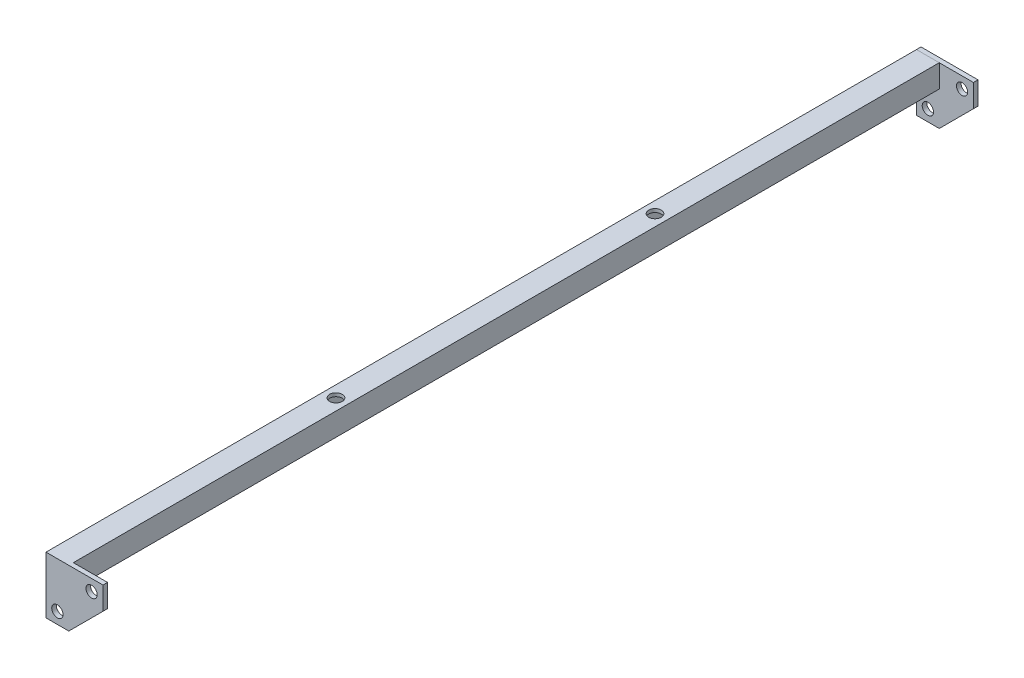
ISO-10303-21;
HEADER;
FILE_DESCRIPTION(('STEP AP214'),'2;1');
FILE_NAME('part.step','',(''),(''),'','','');
FILE_SCHEMA(('AUTOMOTIVE_DESIGN { 1 0 10303 214 1 1 1 1 }'));
ENDSEC;
DATA;
#1=APPLICATION_CONTEXT('core data for automotive mechanical design processes');
#2=APPLICATION_PROTOCOL_DEFINITION('international standard','automotive_design',2000,#1);
#3=PRODUCT_CONTEXT('',#1,'mechanical');
#4=PRODUCT('Part','Part','',(#3));
#5=PRODUCT_RELATED_PRODUCT_CATEGORY('part','',(#4));
#6=PRODUCT_DEFINITION_FORMATION('','',#4);
#7=PRODUCT_DEFINITION_CONTEXT('part definition',#1,'design');
#8=PRODUCT_DEFINITION('design','',#6,#7);
#9=PRODUCT_DEFINITION_SHAPE('','',#8);
#10=(LENGTH_UNIT() NAMED_UNIT(*) SI_UNIT(.MILLI.,.METRE.));
#11=(NAMED_UNIT(*) PLANE_ANGLE_UNIT() SI_UNIT($,.RADIAN.));
#12=(NAMED_UNIT(*) SI_UNIT($,.STERADIAN.) SOLID_ANGLE_UNIT());
#13=UNCERTAINTY_MEASURE_WITH_UNIT(LENGTH_MEASURE(1.E-05),#10,'distance_accuracy_value','');
#14=(GEOMETRIC_REPRESENTATION_CONTEXT(3) GLOBAL_UNCERTAINTY_ASSIGNED_CONTEXT((#13)) GLOBAL_UNIT_ASSIGNED_CONTEXT((#10,
#11,#12)) REPRESENTATION_CONTEXT('',''));
#15=CARTESIAN_POINT('',(0.,0.,0.));
#16=DIRECTION('',(0.,0.,1.));
#17=DIRECTION('',(1.,0.,0.));
#18=AXIS2_PLACEMENT_3D('',#15,#16,#17);
#19=CARTESIAN_POINT('',(50.0000000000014,719.999999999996,763.999999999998));
#20=DIRECTION('',(0.,0.,1.));
#21=DIRECTION('',(1.,0.,0.));
#22=AXIS2_PLACEMENT_3D('',#19,#20,#21);
#23=PLANE('',#22);
#24=CARTESIAN_POINT('',(40.0000000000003,760.000000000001,763.999999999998));
#25=DIRECTION('',(0.,0.,-1.));
#26=DIRECTION('',(-1.,0.,0.));
#27=AXIS2_PLACEMENT_3D('',#24,#25,#26);
#28=CIRCLE('',#27,4.90359405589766);
#29=CARTESIAN_POINT('',(35.0964059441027,760.000000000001,763.999999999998));
#30=VERTEX_POINT('',#29);
#31=EDGE_CURVE('E269',#30,#30,#28,.T.);
#32=ORIENTED_EDGE('',*,*,#31,.F.);
#33=EDGE_LOOP('',(#32));
#34=FACE_BOUND('',#33,.T.);
#35=DIRECTION('',(0.,1.,0.));
#36=VECTOR('',#35,1.);
#37=CARTESIAN_POINT('',(1.36491529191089E-12,769.999999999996,763.999999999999));
#38=LINE('',#37,#36);
#39=CARTESIAN_POINT('',(-2.52565716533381E-13,719.999999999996,763.999999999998));
#40=VERTEX_POINT('',#39);
#41=CARTESIAN_POINT('',(0.,750.,763.999999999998));
#42=VERTEX_POINT('',#41);
#43=EDGE_CURVE('E295',#40,#42,#38,.T.);
#44=ORIENTED_EDGE('',*,*,#43,.T.);
#45=DIRECTION('',(1.,0.,0.));
#46=VECTOR('',#45,1.);
#47=CARTESIAN_POINT('',(-1.54560033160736E-13,750.,763.999999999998));
#48=LINE('',#47,#46);
#49=CARTESIAN_POINT('',(20.0000000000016,750.,763.999999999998));
#50=VERTEX_POINT('',#49);
#51=EDGE_CURVE('E158',#42,#50,#48,.T.);
#52=ORIENTED_EDGE('',*,*,#51,.T.);
#53=DIRECTION('',(0.,1.,0.));
#54=VECTOR('',#53,1.);
#55=CARTESIAN_POINT('',(20.0000000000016,770.,763.999999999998));
#56=LINE('',#55,#54);
#57=CARTESIAN_POINT('',(20.0000000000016,769.999999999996,763.999999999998));
#58=VERTEX_POINT('',#57);
#59=EDGE_CURVE('E146',#50,#58,#56,.T.);
#60=ORIENTED_EDGE('',*,*,#59,.T.);
#61=DIRECTION('',(1.,0.,0.));
#62=VECTOR('',#61,1.);
#63=CARTESIAN_POINT('',(50.0000000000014,769.999999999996,763.999999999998));
#64=LINE('',#63,#62);
#65=CARTESIAN_POINT('',(50.0000000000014,769.999999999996,763.999999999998));
#66=VERTEX_POINT('',#65);
#67=EDGE_CURVE('E159',#58,#66,#64,.T.);
#68=ORIENTED_EDGE('',*,*,#67,.T.);
#69=DIRECTION('',(0.,-1.,0.));
#70=VECTOR('',#69,1.);
#71=CARTESIAN_POINT('',(50.0000000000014,749.999999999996,763.999999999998));
#72=LINE('',#71,#70);
#73=CARTESIAN_POINT('',(50.0000000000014,749.999999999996,763.999999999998));
#74=VERTEX_POINT('',#73);
#75=EDGE_CURVE('E313',#66,#74,#72,.T.);
#76=ORIENTED_EDGE('',*,*,#75,.T.);
#77=DIRECTION('',(-0.707106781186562,-0.707106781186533,0.));
#78=VECTOR('',#77,1.);
#79=CARTESIAN_POINT('',(20.0000000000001,719.999999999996,763.999999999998));
#80=LINE('',#79,#78);
#81=CARTESIAN_POINT('',(20.0000000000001,719.999999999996,763.999999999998));
#82=VERTEX_POINT('',#81);
#83=EDGE_CURVE('E312',#74,#82,#80,.T.);
#84=ORIENTED_EDGE('',*,*,#83,.T.);
#85=DIRECTION('',(-1.,0.,0.));
#86=VECTOR('',#85,1.);
#87=CARTESIAN_POINT('',(-2.52565716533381E-13,719.999999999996,763.999999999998));
#88=LINE('',#87,#86);
#89=EDGE_CURVE('E292',#82,#40,#88,.T.);
#90=ORIENTED_EDGE('',*,*,#89,.T.);
#91=EDGE_LOOP('',(#44,#52,#60,#68,#76,#84,#90));
#92=FACE_BOUND('',#91,.T.);
#93=CARTESIAN_POINT('',(10.0000000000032,730.,763.999999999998));
#94=DIRECTION('',(0.,0.,-1.));
#95=DIRECTION('',(-1.,0.,0.));
#96=AXIS2_PLACEMENT_3D('',#93,#94,#95);
#97=CIRCLE('',#96,4.97314944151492);
#98=CARTESIAN_POINT('',(5.02685055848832,730.,763.999999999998));
#99=VERTEX_POINT('',#98);
#100=EDGE_CURVE('E273',#99,#99,#97,.T.);
#101=ORIENTED_EDGE('',*,*,#100,.F.);
#102=EDGE_LOOP('',(#101));
#103=FACE_BOUND('',#102,.T.);
#104=ADVANCED_FACE('F36',(#34,#92,#103),#23,.F.);
#105=CARTESIAN_POINT('',(50.0000000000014,719.999999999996,767.999999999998));
#106=DIRECTION('',(0.,0.,1.));
#107=DIRECTION('',(1.,0.,0.));
#108=AXIS2_PLACEMENT_3D('',#105,#106,#107);
#109=PLANE('',#108);
#110=CARTESIAN_POINT('',(40.0000000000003,760.000000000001,767.999999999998));
#111=DIRECTION('',(0.,0.,-1.));
#112=DIRECTION('',(-1.,0.,0.));
#113=AXIS2_PLACEMENT_3D('',#110,#111,#112);
#114=CIRCLE('',#113,4.90359405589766);
#115=CARTESIAN_POINT('',(35.0964059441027,760.000000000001,767.999999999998));
#116=VERTEX_POINT('',#115);
#117=EDGE_CURVE('E272',#116,#116,#114,.T.);
#118=ORIENTED_EDGE('',*,*,#117,.T.);
#119=EDGE_LOOP('',(#118));
#120=FACE_BOUND('',#119,.T.);
#121=DIRECTION('',(-1.,0.,0.));
#122=VECTOR('',#121,1.);
#123=CARTESIAN_POINT('',(-2.31846168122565E-13,719.999999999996,767.999999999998));
#124=LINE('',#123,#122);
#125=CARTESIAN_POINT('',(20.0000000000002,719.999999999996,767.999999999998));
#126=VERTEX_POINT('',#125);
#127=CARTESIAN_POINT('',(-2.31846168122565E-13,719.999999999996,767.999999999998));
#128=VERTEX_POINT('',#127);
#129=EDGE_CURVE('E275',#126,#128,#124,.T.);
#130=ORIENTED_EDGE('',*,*,#129,.F.);
#131=DIRECTION('',(-0.707106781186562,-0.707106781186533,0.));
#132=VECTOR('',#131,1.);
#133=CARTESIAN_POINT('',(20.0000000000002,719.999999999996,767.999999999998));
#134=LINE('',#133,#132);
#135=CARTESIAN_POINT('',(50.0000000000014,749.999999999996,767.999999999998));
#136=VERTEX_POINT('',#135);
#137=EDGE_CURVE('E290',#136,#126,#134,.T.);
#138=ORIENTED_EDGE('',*,*,#137,.F.);
#139=DIRECTION('',(0.,-1.,0.));
#140=VECTOR('',#139,1.);
#141=CARTESIAN_POINT('',(50.0000000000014,749.999999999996,767.999999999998));
#142=LINE('',#141,#140);
#143=CARTESIAN_POINT('',(50.0000000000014,769.999999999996,767.999999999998));
#144=VERTEX_POINT('',#143);
#145=EDGE_CURVE('E288',#144,#136,#142,.T.);
#146=ORIENTED_EDGE('',*,*,#145,.F.);
#147=DIRECTION('',(1.,0.,0.));
#148=VECTOR('',#147,1.);
#149=CARTESIAN_POINT('',(50.0000000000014,769.999999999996,767.999999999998));
#150=LINE('',#149,#148);
#151=CARTESIAN_POINT('',(1.38563484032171E-12,769.999999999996,767.999999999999));
#152=VERTEX_POINT('',#151);
#153=EDGE_CURVE('E286',#152,#144,#150,.T.);
#154=ORIENTED_EDGE('',*,*,#153,.F.);
#155=DIRECTION('',(0.,1.,0.));
#156=VECTOR('',#155,1.);
#157=CARTESIAN_POINT('',(1.38563484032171E-12,769.999999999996,767.999999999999));
#158=LINE('',#157,#156);
#159=EDGE_CURVE('E284',#128,#152,#158,.T.);
#160=ORIENTED_EDGE('',*,*,#159,.F.);
#161=EDGE_LOOP('',(#130,#138,#146,#154,#160));
#162=FACE_BOUND('',#161,.T.);
#163=CARTESIAN_POINT('',(10.0000000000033,730.,767.999999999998));
#164=DIRECTION('',(0.,0.,-1.));
#165=DIRECTION('',(-1.,0.,0.));
#166=AXIS2_PLACEMENT_3D('',#163,#164,#165);
#167=CIRCLE('',#166,4.97314944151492);
#168=CARTESIAN_POINT('',(5.02685055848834,730.,767.999999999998));
#169=VERTEX_POINT('',#168);
#170=EDGE_CURVE('E278',#169,#169,#167,.T.);
#171=ORIENTED_EDGE('',*,*,#170,.T.);
#172=EDGE_LOOP('',(#171));
#173=FACE_BOUND('',#172,.T.);
#174=ADVANCED_FACE('F213',(#120,#162,#173),#109,.T.);
#175=CARTESIAN_POINT('',(-2.52565716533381E-13,719.999999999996,763.999999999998));
#176=DIRECTION('',(0.,1.,0.));
#177=DIRECTION('',(0.,0.,1.));
#178=AXIS2_PLACEMENT_3D('',#175,#176,#177);
#179=PLANE('',#178);
#180=ORIENTED_EDGE('',*,*,#129,.T.);
#181=DIRECTION('',(0.,0.,1.));
#182=VECTOR('',#181,1.);
#183=CARTESIAN_POINT('',(-2.52565716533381E-13,719.999999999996,763.999999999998));
#184=LINE('',#183,#182);
#185=EDGE_CURVE('E12',#40,#128,#184,.T.);
#186=ORIENTED_EDGE('',*,*,#185,.F.);
#187=ORIENTED_EDGE('',*,*,#89,.F.);
#188=DIRECTION('',(0.,0.,1.));
#189=VECTOR('',#188,1.);
#190=CARTESIAN_POINT('',(20.0000000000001,719.999999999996,763.999999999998));
#191=LINE('',#190,#189);
#192=EDGE_CURVE('E309',#82,#126,#191,.T.);
#193=ORIENTED_EDGE('',*,*,#192,.T.);
#194=EDGE_LOOP('',(#180,#186,#187,#193));
#195=FACE_BOUND('',#194,.T.);
#196=ADVANCED_FACE('F38',(#195),#179,.F.);
#197=CARTESIAN_POINT('',(1.36491529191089E-12,769.999999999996,763.999999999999));
#198=DIRECTION('',(1.,0.,0.));
#199=DIRECTION('',(0.,1.,0.));
#200=AXIS2_PLACEMENT_3D('',#197,#198,#199);
#201=PLANE('',#200);
#202=ORIENTED_EDGE('',*,*,#159,.T.);
#203=DIRECTION('',(0.,0.,1.));
#204=VECTOR('',#203,1.);
#205=CARTESIAN_POINT('',(1.36491529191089E-12,769.999999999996,763.999999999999));
#206=LINE('',#205,#204);
#207=CARTESIAN_POINT('',(1.60288449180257E-12,770.,4.));
#208=VERTEX_POINT('',#207);
#209=EDGE_CURVE('E45',#208,#152,#206,.T.);
#210=ORIENTED_EDGE('',*,*,#209,.F.);
#211=DIRECTION('',(0.,-1.,0.));
#212=VECTOR('',#211,1.);
#213=CARTESIAN_POINT('',(1.60288449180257E-12,770.,4.));
#214=LINE('',#213,#212);
#215=CARTESIAN_POINT('',(0.,750.,4.));
#216=VERTEX_POINT('',#215);
#217=EDGE_CURVE('E336',#208,#216,#214,.T.);
#218=ORIENTED_EDGE('',*,*,#217,.T.);
#219=DIRECTION('',(0.,0.,-1.));
#220=VECTOR('',#219,1.);
#221=CARTESIAN_POINT('',(0.,750.,792.284271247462));
#222=LINE('',#221,#220);
#223=EDGE_CURVE('E172',#42,#216,#222,.T.);
#224=ORIENTED_EDGE('',*,*,#223,.F.);
#225=ORIENTED_EDGE('',*,*,#43,.F.);
#226=ORIENTED_EDGE('',*,*,#185,.T.);
#227=EDGE_LOOP('',(#202,#210,#218,#224,#225,#226));
#228=FACE_BOUND('',#227,.T.);
#229=ADVANCED_FACE('F332',(#228),#201,.F.);
#230=CARTESIAN_POINT('',(50.0000000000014,769.999999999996,763.999999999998));
#231=DIRECTION('',(0.,-1.,0.));
#232=DIRECTION('',(0.,0.,-1.));
#233=AXIS2_PLACEMENT_3D('',#230,#231,#232);
#234=PLANE('',#233);
#235=CARTESIAN_POINT('',(10.0000000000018,770.,523.499999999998));
#236=DIRECTION('',(0.,1.,0.));
#237=DIRECTION('',(0.,0.,1.));
#238=AXIS2_PLACEMENT_3D('',#235,#236,#237);
#239=CIRCLE('',#238,5.50000000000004);
#240=CARTESIAN_POINT('',(10.0000000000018,770.,528.999999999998));
#241=VERTEX_POINT('',#240);
#242=EDGE_CURVE('E383',#241,#241,#239,.T.);
#243=ORIENTED_EDGE('',*,*,#242,.F.);
#244=EDGE_LOOP('',(#243));
#245=FACE_BOUND('',#244,.T.);
#246=CARTESIAN_POINT('',(10.0000000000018,770.,243.499999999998));
#247=DIRECTION('',(0.,1.,0.));
#248=DIRECTION('',(0.,0.,1.));
#249=AXIS2_PLACEMENT_3D('',#246,#247,#248);
#250=CIRCLE('',#249,5.50000000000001);
#251=CARTESIAN_POINT('',(10.0000000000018,770.,248.999999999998));
#252=VERTEX_POINT('',#251);
#253=EDGE_CURVE('E178',#252,#252,#250,.T.);
#254=ORIENTED_EDGE('',*,*,#253,.F.);
#255=EDGE_LOOP('',(#254));
#256=FACE_BOUND('',#255,.T.);
#257=ORIENTED_EDGE('',*,*,#153,.T.);
#258=DIRECTION('',(0.,0.,1.));
#259=VECTOR('',#258,1.);
#260=CARTESIAN_POINT('',(50.0000000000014,769.999999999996,763.999999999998));
#261=LINE('',#260,#259);
#262=EDGE_CURVE('E303',#66,#144,#261,.T.);
#263=ORIENTED_EDGE('',*,*,#262,.F.);
#264=ORIENTED_EDGE('',*,*,#67,.F.);
#265=DIRECTION('',(0.,0.,-1.));
#266=VECTOR('',#265,1.);
#267=CARTESIAN_POINT('',(20.0000000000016,770.,792.284271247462));
#268=LINE('',#267,#266);
#269=CARTESIAN_POINT('',(20.0000000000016,770.,4.));
#270=VERTEX_POINT('',#269);
#271=EDGE_CURVE('E162',#58,#270,#268,.T.);
#272=ORIENTED_EDGE('',*,*,#271,.T.);
#273=DIRECTION('',(-1.,0.,0.));
#274=VECTOR('',#273,1.);
#275=CARTESIAN_POINT('',(1.60288449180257E-12,770.,4.));
#276=LINE('',#275,#274);
#277=EDGE_CURVE('E165',#270,#208,#276,.T.);
#278=ORIENTED_EDGE('',*,*,#277,.T.);
#279=ORIENTED_EDGE('',*,*,#209,.T.);
#280=EDGE_LOOP('',(#257,#263,#264,#272,#278,#279));
#281=FACE_BOUND('',#280,.T.);
#282=ADVANCED_FACE('F320',(#245,#256,#281),#234,.F.);
#283=CARTESIAN_POINT('',(50.0000000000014,749.999999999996,763.999999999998));
#284=DIRECTION('',(-1.,0.,0.));
#285=DIRECTION('',(0.,0.,1.));
#286=AXIS2_PLACEMENT_3D('',#283,#284,#285);
#287=PLANE('',#286);
#288=ORIENTED_EDGE('',*,*,#145,.T.);
#289=DIRECTION('',(0.,0.,1.));
#290=VECTOR('',#289,1.);
#291=CARTESIAN_POINT('',(50.0000000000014,749.999999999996,763.999999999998));
#292=LINE('',#291,#290);
#293=EDGE_CURVE('E306',#74,#136,#292,.T.);
#294=ORIENTED_EDGE('',*,*,#293,.F.);
#295=ORIENTED_EDGE('',*,*,#75,.F.);
#296=ORIENTED_EDGE('',*,*,#262,.T.);
#297=EDGE_LOOP('',(#288,#294,#295,#296));
#298=FACE_BOUND('',#297,.T.);
#299=ADVANCED_FACE('F265',(#298),#287,.F.);
#300=CARTESIAN_POINT('',(20.0000000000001,719.999999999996,763.999999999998));
#301=DIRECTION('',(-0.707106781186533,0.707106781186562,0.));
#302=DIRECTION('',(-0.707106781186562,-0.707106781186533,0.));
#303=AXIS2_PLACEMENT_3D('',#300,#301,#302);
#304=PLANE('',#303);
#305=ORIENTED_EDGE('',*,*,#137,.T.);
#306=ORIENTED_EDGE('',*,*,#192,.F.);
#307=ORIENTED_EDGE('',*,*,#83,.F.);
#308=ORIENTED_EDGE('',*,*,#293,.T.);
#309=EDGE_LOOP('',(#305,#306,#307,#308));
#310=FACE_BOUND('',#309,.T.);
#311=ADVANCED_FACE('F260',(#310),#304,.F.);
#312=CARTESIAN_POINT('',(40.0000000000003,760.000000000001,763.999999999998));
#313=DIRECTION('',(0.,0.,1.));
#314=DIRECTION('',(1.,0.,0.));
#315=AXIS2_PLACEMENT_3D('',#312,#313,#314);
#316=CYLINDRICAL_SURFACE('',#315,4.90359405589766);
#317=ORIENTED_EDGE('',*,*,#31,.T.);
#318=EDGE_LOOP('',(#317));
#319=FACE_BOUND('',#318,.T.);
#320=ORIENTED_EDGE('',*,*,#117,.F.);
#321=EDGE_LOOP('',(#320));
#322=FACE_BOUND('',#321,.T.);
#323=ADVANCED_FACE('F257',(#319,#322),#316,.F.);
#324=CARTESIAN_POINT('',(10.0000000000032,730.,763.999999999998));
#325=DIRECTION('',(0.,0.,1.));
#326=DIRECTION('',(1.,0.,0.));
#327=AXIS2_PLACEMENT_3D('',#324,#325,#326);
#328=CYLINDRICAL_SURFACE('',#327,4.97314944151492);
#329=ORIENTED_EDGE('',*,*,#100,.T.);
#330=EDGE_LOOP('',(#329));
#331=FACE_BOUND('',#330,.T.);
#332=ORIENTED_EDGE('',*,*,#170,.F.);
#333=EDGE_LOOP('',(#332));
#334=FACE_BOUND('',#333,.T.);
#335=ADVANCED_FACE('F251',(#331,#334),#328,.F.);
#336=CARTESIAN_POINT('',(20.0000000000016,770.,792.284271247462));
#337=DIRECTION('',(-1.,0.,0.));
#338=DIRECTION('',(0.,-1.,0.));
#339=AXIS2_PLACEMENT_3D('',#336,#337,#338);
#340=PLANE('',#339);
#341=ORIENTED_EDGE('',*,*,#59,.F.);
#342=DIRECTION('',(0.,0.,-1.));
#343=VECTOR('',#342,1.);
#344=CARTESIAN_POINT('',(20.0000000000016,750.,792.284271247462));
#345=LINE('',#344,#343);
#346=CARTESIAN_POINT('',(20.0000000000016,750.,4.));
#347=VERTEX_POINT('',#346);
#348=EDGE_CURVE('E164',#50,#347,#345,.T.);
#349=ORIENTED_EDGE('',*,*,#348,.T.);
#350=DIRECTION('',(0.,1.,0.));
#351=VECTOR('',#350,1.);
#352=CARTESIAN_POINT('',(20.0000000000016,770.,4.));
#353=LINE('',#352,#351);
#354=EDGE_CURVE('E345',#347,#270,#353,.T.);
#355=ORIENTED_EDGE('',*,*,#354,.T.);
#356=ORIENTED_EDGE('',*,*,#271,.F.);
#357=EDGE_LOOP('',(#341,#349,#355,#356));
#358=FACE_BOUND('',#357,.T.);
#359=ADVANCED_FACE('F248',(#358),#340,.F.);
#360=CARTESIAN_POINT('',(0.,750.,792.284271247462));
#361=DIRECTION('',(0.,1.,0.));
#362=DIRECTION('',(0.,0.,1.));
#363=AXIS2_PLACEMENT_3D('',#360,#361,#362);
#364=PLANE('',#363);
#365=CARTESIAN_POINT('',(10.0000000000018,750.,523.499999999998));
#366=DIRECTION('',(0.,1.,0.));
#367=DIRECTION('',(0.,0.,1.));
#368=AXIS2_PLACEMENT_3D('',#365,#366,#367);
#369=CIRCLE('',#368,5.50000000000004);
#370=CARTESIAN_POINT('',(10.0000000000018,750.,528.999999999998));
#371=VERTEX_POINT('',#370);
#372=EDGE_CURVE('E184',#371,#371,#369,.T.);
#373=ORIENTED_EDGE('',*,*,#372,.T.);
#374=EDGE_LOOP('',(#373));
#375=FACE_BOUND('',#374,.T.);
#376=CARTESIAN_POINT('',(10.0000000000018,750.,243.499999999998));
#377=DIRECTION('',(0.,1.,0.));
#378=DIRECTION('',(0.,0.,1.));
#379=AXIS2_PLACEMENT_3D('',#376,#377,#378);
#380=CIRCLE('',#379,5.50000000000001);
#381=CARTESIAN_POINT('',(10.0000000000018,750.,248.999999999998));
#382=VERTEX_POINT('',#381);
#383=EDGE_CURVE('E131',#382,#382,#380,.T.);
#384=ORIENTED_EDGE('',*,*,#383,.T.);
#385=EDGE_LOOP('',(#384));
#386=FACE_BOUND('',#385,.T.);
#387=ORIENTED_EDGE('',*,*,#51,.F.);
#388=ORIENTED_EDGE('',*,*,#223,.T.);
#389=DIRECTION('',(1.,0.,0.));
#390=VECTOR('',#389,1.);
#391=CARTESIAN_POINT('',(0.,750.,4.));
#392=LINE('',#391,#390);
#393=EDGE_CURVE('E340',#216,#347,#392,.T.);
#394=ORIENTED_EDGE('',*,*,#393,.T.);
#395=ORIENTED_EDGE('',*,*,#348,.F.);
#396=EDGE_LOOP('',(#387,#388,#394,#395));
#397=FACE_BOUND('',#396,.T.);
#398=ADVANCED_FACE('F195',(#375,#386,#397),#364,.F.);
#399=CARTESIAN_POINT('',(0.,750.,4.));
#400=DIRECTION('',(0.,0.,1.));
#401=DIRECTION('',(1.,0.,0.));
#402=AXIS2_PLACEMENT_3D('',#399,#400,#401);
#403=PLANE('',#402);
#404=ORIENTED_EDGE('',*,*,#217,.F.);
#405=ORIENTED_EDGE('',*,*,#277,.F.);
#406=ORIENTED_EDGE('',*,*,#354,.F.);
#407=ORIENTED_EDGE('',*,*,#393,.F.);
#408=EDGE_LOOP('',(#404,#405,#406,#407));
#409=FACE_BOUND('',#408,.T.);
#410=DIRECTION('',(-1.,0.,0.));
#411=VECTOR('',#410,1.);
#412=CARTESIAN_POINT('',(3.,767.,4.));
#413=LINE('',#412,#411);
#414=CARTESIAN_POINT('',(17.0000000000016,767.,4.));
#415=VERTEX_POINT('',#414);
#416=CARTESIAN_POINT('',(3.,767.,4.));
#417=VERTEX_POINT('',#416);
#418=EDGE_CURVE('E152',#415,#417,#413,.T.);
#419=ORIENTED_EDGE('',*,*,#418,.T.);
#420=DIRECTION('',(0.,-1.,0.));
#421=VECTOR('',#420,1.);
#422=CARTESIAN_POINT('',(3.,767.,4.));
#423=LINE('',#422,#421);
#424=CARTESIAN_POINT('',(3.,753.,4.));
#425=VERTEX_POINT('',#424);
#426=EDGE_CURVE('E369',#417,#425,#423,.T.);
#427=ORIENTED_EDGE('',*,*,#426,.T.);
#428=DIRECTION('',(1.,0.,0.));
#429=VECTOR('',#428,1.);
#430=CARTESIAN_POINT('',(3.,753.,4.));
#431=LINE('',#430,#429);
#432=CARTESIAN_POINT('',(17.0000000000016,753.,4.));
#433=VERTEX_POINT('',#432);
#434=EDGE_CURVE('E137',#425,#433,#431,.T.);
#435=ORIENTED_EDGE('',*,*,#434,.T.);
#436=DIRECTION('',(0.,1.,0.));
#437=VECTOR('',#436,1.);
#438=CARTESIAN_POINT('',(17.0000000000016,767.,4.));
#439=LINE('',#438,#437);
#440=EDGE_CURVE('E363',#433,#415,#439,.T.);
#441=ORIENTED_EDGE('',*,*,#440,.T.);
#442=EDGE_LOOP('',(#419,#427,#435,#441));
#443=FACE_BOUND('',#442,.T.);
#444=ADVANCED_FACE('F243',(#409,#443),#403,.F.);
#445=CARTESIAN_POINT('',(17.0000000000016,767.,792.284271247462));
#446=DIRECTION('',(-1.,0.,0.));
#447=DIRECTION('',(0.,-1.,0.));
#448=AXIS2_PLACEMENT_3D('',#445,#446,#447);
#449=PLANE('',#448);
#450=DIRECTION('',(0.,0.,-1.));
#451=VECTOR('',#450,1.);
#452=CARTESIAN_POINT('',(17.0000000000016,753.,792.284271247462));
#453=LINE('',#452,#451);
#454=CARTESIAN_POINT('',(17.0000000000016,753.,763.999999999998));
#455=VERTEX_POINT('',#454);
#456=EDGE_CURVE('E142',#455,#433,#453,.T.);
#457=ORIENTED_EDGE('',*,*,#456,.F.);
#458=DIRECTION('',(0.,1.,0.));
#459=VECTOR('',#458,1.);
#460=CARTESIAN_POINT('',(17.0000000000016,767.,763.999999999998));
#461=LINE('',#460,#459);
#462=CARTESIAN_POINT('',(17.0000000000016,767.,763.999999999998));
#463=VERTEX_POINT('',#462);
#464=EDGE_CURVE('E58',#455,#463,#461,.T.);
#465=ORIENTED_EDGE('',*,*,#464,.T.);
#466=DIRECTION('',(0.,0.,-1.));
#467=VECTOR('',#466,1.);
#468=CARTESIAN_POINT('',(17.0000000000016,767.,792.284271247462));
#469=LINE('',#468,#467);
#470=EDGE_CURVE('E360',#463,#415,#469,.T.);
#471=ORIENTED_EDGE('',*,*,#470,.T.);
#472=ORIENTED_EDGE('',*,*,#440,.F.);
#473=EDGE_LOOP('',(#457,#465,#471,#472));
#474=FACE_BOUND('',#473,.T.);
#475=ADVANCED_FACE('F246',(#474),#449,.T.);
#476=CARTESIAN_POINT('',(3.,753.,792.284271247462));
#477=DIRECTION('',(0.,1.,0.));
#478=DIRECTION('',(0.,0.,1.));
#479=AXIS2_PLACEMENT_3D('',#476,#477,#478);
#480=PLANE('',#479);
#481=CARTESIAN_POINT('',(10.0000000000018,753.,523.499999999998));
#482=DIRECTION('',(0.,1.,0.));
#483=DIRECTION('',(0.,0.,1.));
#484=AXIS2_PLACEMENT_3D('',#481,#482,#483);
#485=CIRCLE('',#484,5.50000000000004);
#486=CARTESIAN_POINT('',(10.0000000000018,753.,528.999999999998));
#487=VERTEX_POINT('',#486);
#488=EDGE_CURVE('E189',#487,#487,#485,.T.);
#489=ORIENTED_EDGE('',*,*,#488,.F.);
#490=EDGE_LOOP('',(#489));
#491=FACE_BOUND('',#490,.T.);
#492=CARTESIAN_POINT('',(10.0000000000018,753.,243.499999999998));
#493=DIRECTION('',(0.,1.,0.));
#494=DIRECTION('',(0.,0.,1.));
#495=AXIS2_PLACEMENT_3D('',#492,#493,#494);
#496=CIRCLE('',#495,5.50000000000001);
#497=CARTESIAN_POINT('',(10.0000000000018,753.,248.999999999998));
#498=VERTEX_POINT('',#497);
#499=EDGE_CURVE('E177',#498,#498,#496,.T.);
#500=ORIENTED_EDGE('',*,*,#499,.F.);
#501=EDGE_LOOP('',(#500));
#502=FACE_BOUND('',#501,.T.);
#503=DIRECTION('',(0.,0.,-1.));
#504=VECTOR('',#503,1.);
#505=CARTESIAN_POINT('',(3.,753.,792.284271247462));
#506=LINE('',#505,#504);
#507=CARTESIAN_POINT('',(3.,753.,763.999999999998));
#508=VERTEX_POINT('',#507);
#509=EDGE_CURVE('E134',#508,#425,#506,.T.);
#510=ORIENTED_EDGE('',*,*,#509,.F.);
#511=DIRECTION('',(1.,0.,0.));
#512=VECTOR('',#511,1.);
#513=CARTESIAN_POINT('',(2.99999999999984,753.,763.999999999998));
#514=LINE('',#513,#512);
#515=EDGE_CURVE('E123',#508,#455,#514,.T.);
#516=ORIENTED_EDGE('',*,*,#515,.T.);
#517=ORIENTED_EDGE('',*,*,#456,.T.);
#518=ORIENTED_EDGE('',*,*,#434,.F.);
#519=EDGE_LOOP('',(#510,#516,#517,#518));
#520=FACE_BOUND('',#519,.T.);
#521=ADVANCED_FACE('F135',(#491,#502,#520),#480,.T.);
#522=CARTESIAN_POINT('',(3.,767.,792.284271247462));
#523=DIRECTION('',(1.,0.,0.));
#524=DIRECTION('',(0.,0.,-1.));
#525=AXIS2_PLACEMENT_3D('',#522,#523,#524);
#526=PLANE('',#525);
#527=DIRECTION('',(0.,0.,-1.));
#528=VECTOR('',#527,1.);
#529=CARTESIAN_POINT('',(3.,767.,792.284271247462));
#530=LINE('',#529,#528);
#531=CARTESIAN_POINT('',(3.,767.,763.999999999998));
#532=VERTEX_POINT('',#531);
#533=EDGE_CURVE('E141',#532,#417,#530,.T.);
#534=ORIENTED_EDGE('',*,*,#533,.F.);
#535=DIRECTION('',(0.,-1.,0.));
#536=VECTOR('',#535,1.);
#537=CARTESIAN_POINT('',(3.,767.,763.999999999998));
#538=LINE('',#537,#536);
#539=EDGE_CURVE('E127',#532,#508,#538,.T.);
#540=ORIENTED_EDGE('',*,*,#539,.T.);
#541=ORIENTED_EDGE('',*,*,#509,.T.);
#542=ORIENTED_EDGE('',*,*,#426,.F.);
#543=EDGE_LOOP('',(#534,#540,#541,#542));
#544=FACE_BOUND('',#543,.T.);
#545=ADVANCED_FACE('F144',(#544),#526,.T.);
#546=CARTESIAN_POINT('',(3.,767.,792.284271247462));
#547=DIRECTION('',(0.,-1.,0.));
#548=DIRECTION('',(0.,0.,-1.));
#549=AXIS2_PLACEMENT_3D('',#546,#547,#548);
#550=PLANE('',#549);
#551=CARTESIAN_POINT('',(10.0000000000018,767.,523.499999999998));
#552=DIRECTION('',(0.,-1.,0.));
#553=DIRECTION('',(0.,0.,-1.));
#554=AXIS2_PLACEMENT_3D('',#551,#552,#553);
#555=CIRCLE('',#554,5.50000000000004);
#556=CARTESIAN_POINT('',(10.0000000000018,767.,517.999999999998));
#557=VERTEX_POINT('',#556);
#558=EDGE_CURVE('E40',#557,#557,#555,.T.);
#559=ORIENTED_EDGE('',*,*,#558,.F.);
#560=EDGE_LOOP('',(#559));
#561=FACE_BOUND('',#560,.T.);
#562=CARTESIAN_POINT('',(10.0000000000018,767.,243.499999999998));
#563=DIRECTION('',(0.,-1.,0.));
#564=DIRECTION('',(0.,0.,-1.));
#565=AXIS2_PLACEMENT_3D('',#562,#563,#564);
#566=CIRCLE('',#565,5.50000000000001);
#567=CARTESIAN_POINT('',(10.0000000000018,767.,237.999999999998));
#568=VERTEX_POINT('',#567);
#569=EDGE_CURVE('E175',#568,#568,#566,.T.);
#570=ORIENTED_EDGE('',*,*,#569,.F.);
#571=EDGE_LOOP('',(#570));
#572=FACE_BOUND('',#571,.T.);
#573=ORIENTED_EDGE('',*,*,#470,.F.);
#574=DIRECTION('',(-1.,0.,0.));
#575=VECTOR('',#574,1.);
#576=CARTESIAN_POINT('',(2.99999999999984,767.,763.999999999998));
#577=LINE('',#576,#575);
#578=EDGE_CURVE('E53',#463,#532,#577,.T.);
#579=ORIENTED_EDGE('',*,*,#578,.T.);
#580=ORIENTED_EDGE('',*,*,#533,.T.);
#581=ORIENTED_EDGE('',*,*,#418,.F.);
#582=EDGE_LOOP('',(#573,#579,#580,#581));
#583=FACE_BOUND('',#582,.T.);
#584=ADVANCED_FACE('F227',(#561,#572,#583),#550,.T.);
#585=ORIENTED_EDGE('',*,*,#578,.F.);
#586=ORIENTED_EDGE('',*,*,#464,.F.);
#587=ORIENTED_EDGE('',*,*,#515,.F.);
#588=ORIENTED_EDGE('',*,*,#539,.F.);
#589=EDGE_LOOP('',(#585,#586,#587,#588));
#590=FACE_BOUND('',#589,.T.);
#591=ADVANCED_FACE('F125',(#590),#23,.F.);
#592=CARTESIAN_POINT('',(10.0000000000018,719.999974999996,243.499999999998));
#593=DIRECTION('',(0.,1.,0.));
#594=DIRECTION('',(0.,0.,1.));
#595=AXIS2_PLACEMENT_3D('',#592,#593,#594);
#596=CYLINDRICAL_SURFACE('',#595,5.50000000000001);
#597=ORIENTED_EDGE('',*,*,#569,.T.);
#598=EDGE_LOOP('',(#597));
#599=FACE_BOUND('',#598,.T.);
#600=ORIENTED_EDGE('',*,*,#253,.T.);
#601=EDGE_LOOP('',(#600));
#602=FACE_BOUND('',#601,.T.);
#603=ADVANCED_FACE('F201',(#599,#602),#596,.F.);
#604=ORIENTED_EDGE('',*,*,#499,.T.);
#605=EDGE_LOOP('',(#604));
#606=FACE_BOUND('',#605,.T.);
#607=ORIENTED_EDGE('',*,*,#383,.F.);
#608=EDGE_LOOP('',(#607));
#609=FACE_BOUND('',#608,.T.);
#610=ADVANCED_FACE('F198',(#606,#609),#596,.F.);
#611=CARTESIAN_POINT('',(10.0000000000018,719.999974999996,523.499999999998));
#612=DIRECTION('',(0.,1.,0.));
#613=DIRECTION('',(0.,0.,1.));
#614=AXIS2_PLACEMENT_3D('',#611,#612,#613);
#615=CYLINDRICAL_SURFACE('',#614,5.50000000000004);
#616=ORIENTED_EDGE('',*,*,#558,.T.);
#617=EDGE_LOOP('',(#616));
#618=FACE_BOUND('',#617,.T.);
#619=ORIENTED_EDGE('',*,*,#242,.T.);
#620=EDGE_LOOP('',(#619));
#621=FACE_BOUND('',#620,.T.);
#622=ADVANCED_FACE('F200',(#618,#621),#615,.F.);
#623=ORIENTED_EDGE('',*,*,#488,.T.);
#624=EDGE_LOOP('',(#623));
#625=FACE_BOUND('',#624,.T.);
#626=ORIENTED_EDGE('',*,*,#372,.F.);
#627=EDGE_LOOP('',(#626));
#628=FACE_BOUND('',#627,.T.);
#629=ADVANCED_FACE('F208',(#625,#628),#615,.F.);
#630=CLOSED_SHELL('',(#104,#174,#196,#229,#282,#299,#311,#323,#335,#359,#398,#444,#475,#521,
#545,#584,#591,#603,#610,#622,#629));
#631=MANIFOLD_SOLID_BREP('B2',#630);
#632=CARTESIAN_POINT('',(50.0000000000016,770.,4.));
#633=DIRECTION('',(0.,0.,-1.));
#634=DIRECTION('',(-1.,0.,0.));
#635=AXIS2_PLACEMENT_3D('',#632,#633,#634);
#636=PLANE('',#635);
#637=CARTESIAN_POINT('',(10.0000000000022,729.999999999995,4.));
#638=DIRECTION('',(0.,0.,1.));
#639=DIRECTION('',(1.,0.,0.));
#640=AXIS2_PLACEMENT_3D('',#637,#638,#639);
#641=CIRCLE('',#640,4.97314944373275);
#642=CARTESIAN_POINT('',(14.973149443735,729.999999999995,4.));
#643=VERTEX_POINT('',#642);
#644=EDGE_CURVE('E543',#643,#643,#641,.T.);
#645=ORIENTED_EDGE('',*,*,#644,.F.);
#646=EDGE_LOOP('',(#645));
#647=FACE_BOUND('',#646,.T.);
#648=DIRECTION('',(-1.,0.,0.));
#649=VECTOR('',#648,1.);
#650=CARTESIAN_POINT('',(1.60288449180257E-12,770.,4.));
#651=LINE('',#650,#649);
#652=CARTESIAN_POINT('',(50.0000000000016,770.,4.));
#653=VERTEX_POINT('',#652);
#654=CARTESIAN_POINT('',(1.60288449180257E-12,770.,4.));
#655=VERTEX_POINT('',#654);
#656=EDGE_CURVE('E555',#653,#655,#651,.T.);
#657=ORIENTED_EDGE('',*,*,#656,.T.);
#658=DIRECTION('',(0.,-1.,0.));
#659=VECTOR('',#658,1.);
#660=CARTESIAN_POINT('',(1.60288449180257E-12,770.,4.));
#661=LINE('',#660,#659);
#662=CARTESIAN_POINT('',(0.,720.,4.));
#663=VERTEX_POINT('',#662);
#664=EDGE_CURVE('E538',#655,#663,#661,.T.);
#665=ORIENTED_EDGE('',*,*,#664,.T.);
#666=DIRECTION('',(1.,0.,0.));
#667=VECTOR('',#666,1.);
#668=CARTESIAN_POINT('',(0.,720.,4.));
#669=LINE('',#668,#667);
#670=CARTESIAN_POINT('',(20.0000000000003,720.,4.));
#671=VERTEX_POINT('',#670);
#672=EDGE_CURVE('E558',#663,#671,#669,.T.);
#673=ORIENTED_EDGE('',*,*,#672,.T.);
#674=DIRECTION('',(0.707106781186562,0.707106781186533,0.));
#675=VECTOR('',#674,1.);
#676=CARTESIAN_POINT('',(20.0000000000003,720.,4.));
#677=LINE('',#676,#675);
#678=CARTESIAN_POINT('',(50.0000000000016,750.,4.));
#679=VERTEX_POINT('',#678);
#680=EDGE_CURVE('E497',#671,#679,#677,.T.);
#681=ORIENTED_EDGE('',*,*,#680,.T.);
#682=DIRECTION('',(0.,1.,0.));
#683=VECTOR('',#682,1.);
#684=CARTESIAN_POINT('',(50.0000000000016,770.,4.));
#685=LINE('',#684,#683);
#686=EDGE_CURVE('E492',#679,#653,#685,.T.);
#687=ORIENTED_EDGE('',*,*,#686,.T.);
#688=EDGE_LOOP('',(#657,#665,#673,#681,#687));
#689=FACE_BOUND('',#688,.T.);
#690=CARTESIAN_POINT('',(40.0000000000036,759.999999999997,4.));
#691=DIRECTION('',(0.,0.,1.));
#692=DIRECTION('',(1.,0.,0.));
#693=AXIS2_PLACEMENT_3D('',#690,#691,#692);
#694=CIRCLE('',#693,4.90359405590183);
#695=CARTESIAN_POINT('',(44.9035940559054,759.999999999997,4.));
#696=VERTEX_POINT('',#695);
#697=EDGE_CURVE('E578',#696,#696,#694,.T.);
#698=ORIENTED_EDGE('',*,*,#697,.F.);
#699=EDGE_LOOP('',(#698));
#700=FACE_BOUND('',#699,.T.);
#701=ADVANCED_FACE('F477',(#647,#689,#700),#636,.F.);
#702=CARTESIAN_POINT('',(50.0000000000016,770.,0.));
#703=DIRECTION('',(0.,0.,-1.));
#704=DIRECTION('',(-1.,0.,0.));
#705=AXIS2_PLACEMENT_3D('',#702,#703,#704);
#706=PLANE('',#705);
#707=CARTESIAN_POINT('',(10.0000000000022,729.999999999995,0.));
#708=DIRECTION('',(0.,0.,1.));
#709=DIRECTION('',(1.,0.,0.));
#710=AXIS2_PLACEMENT_3D('',#707,#708,#709);
#711=CIRCLE('',#710,4.97314944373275);
#712=CARTESIAN_POINT('',(14.973149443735,729.999999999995,0.));
#713=VERTEX_POINT('',#712);
#714=EDGE_CURVE('E546',#713,#713,#711,.T.);
#715=ORIENTED_EDGE('',*,*,#714,.T.);
#716=EDGE_LOOP('',(#715));
#717=FACE_BOUND('',#716,.T.);
#718=DIRECTION('',(-1.,0.,0.));
#719=VECTOR('',#718,1.);
#720=CARTESIAN_POINT('',(1.60288449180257E-12,770.,0.));
#721=LINE('',#720,#719);
#722=CARTESIAN_POINT('',(50.0000000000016,770.,0.));
#723=VERTEX_POINT('',#722);
#724=CARTESIAN_POINT('',(1.60288449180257E-12,770.,0.));
#725=VERTEX_POINT('',#724);
#726=EDGE_CURVE('E529',#723,#725,#721,.T.);
#727=ORIENTED_EDGE('',*,*,#726,.F.);
#728=DIRECTION('',(0.,1.,0.));
#729=VECTOR('',#728,1.);
#730=CARTESIAN_POINT('',(50.0000000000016,770.,0.));
#731=LINE('',#730,#729);
#732=CARTESIAN_POINT('',(50.0000000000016,750.,0.));
#733=VERTEX_POINT('',#732);
#734=EDGE_CURVE('E553',#733,#723,#731,.T.);
#735=ORIENTED_EDGE('',*,*,#734,.F.);
#736=DIRECTION('',(0.707106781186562,0.707106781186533,0.));
#737=VECTOR('',#736,1.);
#738=CARTESIAN_POINT('',(20.0000000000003,720.,0.));
#739=LINE('',#738,#737);
#740=CARTESIAN_POINT('',(20.0000000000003,720.,0.));
#741=VERTEX_POINT('',#740);
#742=EDGE_CURVE('E551',#741,#733,#739,.T.);
#743=ORIENTED_EDGE('',*,*,#742,.F.);
#744=DIRECTION('',(1.,0.,0.));
#745=VECTOR('',#744,1.);
#746=CARTESIAN_POINT('',(0.,720.,0.));
#747=LINE('',#746,#745);
#748=CARTESIAN_POINT('',(0.,720.,0.));
#749=VERTEX_POINT('',#748);
#750=EDGE_CURVE('E531',#749,#741,#747,.T.);
#751=ORIENTED_EDGE('',*,*,#750,.F.);
#752=DIRECTION('',(0.,-1.,0.));
#753=VECTOR('',#752,1.);
#754=CARTESIAN_POINT('',(1.60288449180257E-12,770.,0.));
#755=LINE('',#754,#753);
#756=EDGE_CURVE('E524',#725,#749,#755,.T.);
#757=ORIENTED_EDGE('',*,*,#756,.F.);
#758=EDGE_LOOP('',(#727,#735,#743,#751,#757));
#759=FACE_BOUND('',#758,.T.);
#760=CARTESIAN_POINT('',(40.0000000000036,759.999999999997,0.));
#761=DIRECTION('',(0.,0.,1.));
#762=DIRECTION('',(1.,0.,0.));
#763=AXIS2_PLACEMENT_3D('',#760,#761,#762);
#764=CIRCLE('',#763,4.90359405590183);
#765=CARTESIAN_POINT('',(44.9035940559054,759.999999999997,0.));
#766=VERTEX_POINT('',#765);
#767=EDGE_CURVE('E580',#766,#766,#764,.T.);
#768=ORIENTED_EDGE('',*,*,#767,.T.);
#769=EDGE_LOOP('',(#768));
#770=FACE_BOUND('',#769,.T.);
#771=ADVANCED_FACE('F525',(#717,#759,#770),#706,.T.);
#772=CARTESIAN_POINT('',(1.60288449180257E-12,770.,4.));
#773=DIRECTION('',(0.,-1.,0.));
#774=DIRECTION('',(0.,0.,-1.));
#775=AXIS2_PLACEMENT_3D('',#772,#773,#774);
#776=PLANE('',#775);
#777=ORIENTED_EDGE('',*,*,#726,.T.);
#778=DIRECTION('',(0.,0.,-1.));
#779=VECTOR('',#778,1.);
#780=CARTESIAN_POINT('',(1.60288449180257E-12,770.,4.));
#781=LINE('',#780,#779);
#782=EDGE_CURVE('E34',#655,#725,#781,.T.);
#783=ORIENTED_EDGE('',*,*,#782,.F.);
#784=ORIENTED_EDGE('',*,*,#656,.F.);
#785=DIRECTION('',(0.,0.,-1.));
#786=VECTOR('',#785,1.);
#787=CARTESIAN_POINT('',(50.0000000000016,770.,4.));
#788=LINE('',#787,#786);
#789=EDGE_CURVE('E542',#653,#723,#788,.T.);
#790=ORIENTED_EDGE('',*,*,#789,.T.);
#791=EDGE_LOOP('',(#777,#783,#784,#790));
#792=FACE_BOUND('',#791,.T.);
#793=ADVANCED_FACE('F479',(#792),#776,.F.);
#794=CARTESIAN_POINT('',(1.60288449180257E-12,770.,4.));
#795=DIRECTION('',(1.,0.,0.));
#796=DIRECTION('',(0.,1.,0.));
#797=AXIS2_PLACEMENT_3D('',#794,#795,#796);
#798=PLANE('',#797);
#799=ORIENTED_EDGE('',*,*,#756,.T.);
#800=DIRECTION('',(0.,0.,-1.));
#801=VECTOR('',#800,1.);
#802=CARTESIAN_POINT('',(0.,720.,4.));
#803=LINE('',#802,#801);
#804=EDGE_CURVE('E485',#663,#749,#803,.T.);
#805=ORIENTED_EDGE('',*,*,#804,.F.);
#806=ORIENTED_EDGE('',*,*,#664,.F.);
#807=ORIENTED_EDGE('',*,*,#782,.T.);
#808=EDGE_LOOP('',(#799,#805,#806,#807));
#809=FACE_BOUND('',#808,.T.);
#810=ADVANCED_FACE('F537',(#809),#798,.F.);
#811=CARTESIAN_POINT('',(0.,720.,4.));
#812=DIRECTION('',(0.,1.,0.));
#813=DIRECTION('',(0.,0.,1.));
#814=AXIS2_PLACEMENT_3D('',#811,#812,#813);
#815=PLANE('',#814);
#816=ORIENTED_EDGE('',*,*,#750,.T.);
#817=DIRECTION('',(0.,0.,-1.));
#818=VECTOR('',#817,1.);
#819=CARTESIAN_POINT('',(20.0000000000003,720.,4.));
#820=LINE('',#819,#818);
#821=EDGE_CURVE('E566',#671,#741,#820,.T.);
#822=ORIENTED_EDGE('',*,*,#821,.F.);
#823=ORIENTED_EDGE('',*,*,#672,.F.);
#824=ORIENTED_EDGE('',*,*,#804,.T.);
#825=EDGE_LOOP('',(#816,#822,#823,#824));
#826=FACE_BOUND('',#825,.T.);
#827=ADVANCED_FACE('F570',(#826),#815,.F.);
#828=CARTESIAN_POINT('',(20.0000000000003,720.,4.));
#829=DIRECTION('',(-0.707106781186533,0.707106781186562,0.));
#830=DIRECTION('',(-0.707106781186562,-0.707106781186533,0.));
#831=AXIS2_PLACEMENT_3D('',#828,#829,#830);
#832=PLANE('',#831);
#833=ORIENTED_EDGE('',*,*,#742,.T.);
#834=DIRECTION('',(0.,0.,-1.));
#835=VECTOR('',#834,1.);
#836=CARTESIAN_POINT('',(50.0000000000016,750.,4.));
#837=LINE('',#836,#835);
#838=EDGE_CURVE('E563',#679,#733,#837,.T.);
#839=ORIENTED_EDGE('',*,*,#838,.F.);
#840=ORIENTED_EDGE('',*,*,#680,.F.);
#841=ORIENTED_EDGE('',*,*,#821,.T.);
#842=EDGE_LOOP('',(#833,#839,#840,#841));
#843=FACE_BOUND('',#842,.T.);
#844=ADVANCED_FACE('F603',(#843),#832,.F.);
#845=CARTESIAN_POINT('',(50.0000000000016,770.,4.));
#846=DIRECTION('',(-1.,0.,0.));
#847=DIRECTION('',(0.,-1.,0.));
#848=AXIS2_PLACEMENT_3D('',#845,#846,#847);
#849=PLANE('',#848);
#850=ORIENTED_EDGE('',*,*,#734,.T.);
#851=ORIENTED_EDGE('',*,*,#789,.F.);
#852=ORIENTED_EDGE('',*,*,#686,.F.);
#853=ORIENTED_EDGE('',*,*,#838,.T.);
#854=EDGE_LOOP('',(#850,#851,#852,#853));
#855=FACE_BOUND('',#854,.T.);
#856=ADVANCED_FACE('F594',(#855),#849,.F.);
#857=CARTESIAN_POINT('',(10.0000000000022,729.999999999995,4.));
#858=DIRECTION('',(0.,0.,-1.));
#859=DIRECTION('',(-1.,0.,0.));
#860=AXIS2_PLACEMENT_3D('',#857,#858,#859);
#861=CYLINDRICAL_SURFACE('',#860,4.97314944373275);
#862=ORIENTED_EDGE('',*,*,#644,.T.);
#863=EDGE_LOOP('',(#862));
#864=FACE_BOUND('',#863,.T.);
#865=ORIENTED_EDGE('',*,*,#714,.F.);
#866=EDGE_LOOP('',(#865));
#867=FACE_BOUND('',#866,.T.);
#868=ADVANCED_FACE('F589',(#864,#867),#861,.F.);
#869=CARTESIAN_POINT('',(40.0000000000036,759.999999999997,4.));
#870=DIRECTION('',(0.,0.,-1.));
#871=DIRECTION('',(-1.,0.,0.));
#872=AXIS2_PLACEMENT_3D('',#869,#870,#871);
#873=CYLINDRICAL_SURFACE('',#872,4.90359405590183);
#874=ORIENTED_EDGE('',*,*,#697,.T.);
#875=EDGE_LOOP('',(#874));
#876=FACE_BOUND('',#875,.T.);
#877=ORIENTED_EDGE('',*,*,#767,.F.);
#878=EDGE_LOOP('',(#877));
#879=FACE_BOUND('',#878,.T.);
#880=ADVANCED_FACE('F587',(#876,#879),#873,.F.);
#881=CLOSED_SHELL('',(#701,#771,#793,#810,#827,#844,#856,#868,#880));
#882=MANIFOLD_SOLID_BREP('B6',#881);
#883=ADVANCED_BREP_SHAPE_REPRESENTATION('',(#18,#631,#882),#14);
#884=SHAPE_DEFINITION_REPRESENTATION(#9,#883);
ENDSEC;
END-ISO-10303-21;
